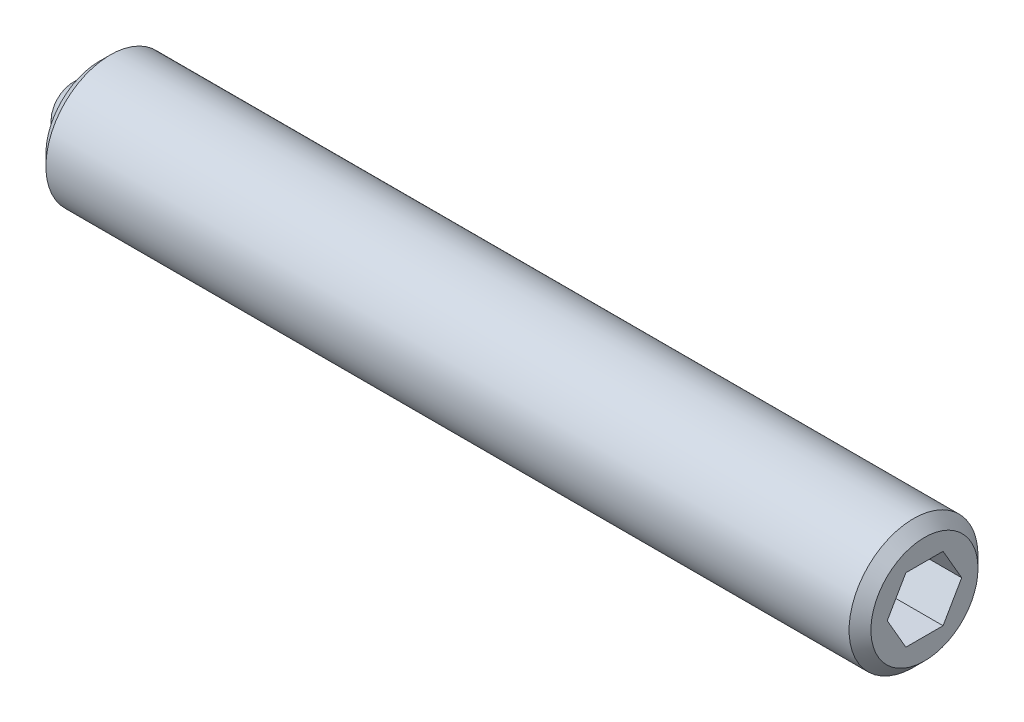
ISO-10303-21;
HEADER;
FILE_DESCRIPTION(('STEP AP214'),'2;1');
FILE_NAME('part.step','',(''),(''),'','','');
FILE_SCHEMA(('AUTOMOTIVE_DESIGN { 1 0 10303 214 1 1 1 1 }'));
ENDSEC;
DATA;
#1=APPLICATION_CONTEXT('core data for automotive mechanical design processes');
#2=APPLICATION_PROTOCOL_DEFINITION('international standard','automotive_design',2000,#1);
#3=PRODUCT_CONTEXT('',#1,'mechanical');
#4=PRODUCT('Part','Part','',(#3));
#5=PRODUCT_RELATED_PRODUCT_CATEGORY('part','',(#4));
#6=PRODUCT_DEFINITION_FORMATION('','',#4);
#7=PRODUCT_DEFINITION_CONTEXT('part definition',#1,'design');
#8=PRODUCT_DEFINITION('design','',#6,#7);
#9=PRODUCT_DEFINITION_SHAPE('','',#8);
#10=(LENGTH_UNIT() NAMED_UNIT(*) SI_UNIT(.MILLI.,.METRE.));
#11=(NAMED_UNIT(*) PLANE_ANGLE_UNIT() SI_UNIT($,.RADIAN.));
#12=(NAMED_UNIT(*) SI_UNIT($,.STERADIAN.) SOLID_ANGLE_UNIT());
#13=UNCERTAINTY_MEASURE_WITH_UNIT(LENGTH_MEASURE(1.E-05),#10,'distance_accuracy_value','');
#14=(GEOMETRIC_REPRESENTATION_CONTEXT(3) GLOBAL_UNCERTAINTY_ASSIGNED_CONTEXT((#13)) GLOBAL_UNIT_ASSIGNED_CONTEXT((#10,
#11,#12)) REPRESENTATION_CONTEXT('',''));
#15=CARTESIAN_POINT('',(0.,0.,0.));
#16=DIRECTION('',(0.,0.,1.));
#17=DIRECTION('',(1.,0.,0.));
#18=AXIS2_PLACEMENT_3D('',#15,#16,#17);
#19=CARTESIAN_POINT('',(0.,0.,0.));
#20=DIRECTION('',(0.,-1.,0.));
#21=DIRECTION('',(0.,0.,-1.));
#22=AXIS2_PLACEMENT_3D('',#19,#20,#21);
#23=SPHERICAL_SURFACE('',#22,0.8);
#24=CARTESIAN_POINT('',(0.,-0.8,0.));
#25=VERTEX_POINT('',#24);
#26=VERTEX_LOOP('',#25);
#27=FACE_BOUND('',#26,.T.);
#28=ADVANCED_FACE('F41',(#27),#23,.T.);
#29=CLOSED_SHELL('',(#28));
#30=MANIFOLD_SOLID_BREP('B2',#29);
#31=CARTESIAN_POINT('',(19.2,0.,0.));
#32=DIRECTION('',(-1.,0.,0.));
#33=DIRECTION('',(0.,0.,1.));
#34=AXIS2_PLACEMENT_3D('',#31,#32,#33);
#35=CYLINDRICAL_SURFACE('',#34,1.5);
#36=CARTESIAN_POINT('',(18.946,0.,0.));
#37=DIRECTION('',(1.,0.,0.));
#38=DIRECTION('',(0.,0.,-1.));
#39=AXIS2_PLACEMENT_3D('',#36,#37,#38);
#40=CIRCLE('',#39,1.5);
#41=CARTESIAN_POINT('',(18.946,0.,-1.5));
#42=VERTEX_POINT('',#41);
#43=EDGE_CURVE('E39',#42,#42,#40,.F.);
#44=ORIENTED_EDGE('',*,*,#43,.T.);
#45=EDGE_LOOP('',(#44));
#46=FACE_BOUND('',#45,.T.);
#47=CARTESIAN_POINT('',(0.254000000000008,0.,0.));
#48=DIRECTION('',(1.,0.,0.));
#49=DIRECTION('',(0.,0.,-1.));
#50=AXIS2_PLACEMENT_3D('',#47,#48,#49);
#51=CIRCLE('',#50,1.5);
#52=CARTESIAN_POINT('',(0.254000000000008,0.,-1.5));
#53=VERTEX_POINT('',#52);
#54=EDGE_CURVE('E176',#53,#53,#51,.T.);
#55=ORIENTED_EDGE('',*,*,#54,.T.);
#56=EDGE_LOOP('',(#55));
#57=FACE_BOUND('',#56,.T.);
#58=ADVANCED_FACE('F54',(#46,#57),#35,.T.);
#59=CARTESIAN_POINT('',(19.2,0.,0.));
#60=DIRECTION('',(1.,0.,0.));
#61=DIRECTION('',(0.,0.,-1.));
#62=AXIS2_PLACEMENT_3D('',#59,#60,#61);
#63=PLANE('',#62);
#64=DIRECTION('',(0.,0.866025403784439,-0.5));
#65=VECTOR('',#64,1.);
#66=CARTESIAN_POINT('',(19.2,-0.75,-0.43301270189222));
#67=LINE('',#66,#65);
#68=CARTESIAN_POINT('',(19.2,-0.75,-0.43301270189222));
#69=VERTEX_POINT('',#68);
#70=CARTESIAN_POINT('',(19.2,0.,-0.866025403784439));
#71=VERTEX_POINT('',#70);
#72=EDGE_CURVE('E77',#69,#71,#67,.T.);
#73=ORIENTED_EDGE('',*,*,#72,.F.);
#74=DIRECTION('',(0.,0.,-1.));
#75=VECTOR('',#74,1.);
#76=CARTESIAN_POINT('',(19.2,-0.75,0.433012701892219));
#77=LINE('',#76,#75);
#78=CARTESIAN_POINT('',(19.2,-0.75,0.433012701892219));
#79=VERTEX_POINT('',#78);
#80=EDGE_CURVE('E143',#79,#69,#77,.T.);
#81=ORIENTED_EDGE('',*,*,#80,.F.);
#82=DIRECTION('',(0.,-0.866025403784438,-0.5));
#83=VECTOR('',#82,1.);
#84=CARTESIAN_POINT('',(19.2,0.,0.866025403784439));
#85=LINE('',#84,#83);
#86=CARTESIAN_POINT('',(19.2,0.,0.866025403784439));
#87=VERTEX_POINT('',#86);
#88=EDGE_CURVE('E169',#87,#79,#85,.T.);
#89=ORIENTED_EDGE('',*,*,#88,.F.);
#90=DIRECTION('',(0.,-0.866025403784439,0.5));
#91=VECTOR('',#90,1.);
#92=CARTESIAN_POINT('',(19.2,0.75,0.433012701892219));
#93=LINE('',#92,#91);
#94=CARTESIAN_POINT('',(19.2,0.75,0.433012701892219));
#95=VERTEX_POINT('',#94);
#96=EDGE_CURVE('E166',#95,#87,#93,.T.);
#97=ORIENTED_EDGE('',*,*,#96,.F.);
#98=DIRECTION('',(0.,0.,1.));
#99=VECTOR('',#98,1.);
#100=CARTESIAN_POINT('',(19.2,0.75,-0.433012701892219));
#101=LINE('',#100,#99);
#102=CARTESIAN_POINT('',(19.2,0.75,-0.433012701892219));
#103=VERTEX_POINT('',#102);
#104=EDGE_CURVE('E163',#103,#95,#101,.T.);
#105=ORIENTED_EDGE('',*,*,#104,.F.);
#106=DIRECTION('',(0.,0.866025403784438,0.5));
#107=VECTOR('',#106,1.);
#108=CARTESIAN_POINT('',(19.2,0.,-0.866025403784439));
#109=LINE('',#108,#107);
#110=EDGE_CURVE('E160',#71,#103,#109,.T.);
#111=ORIENTED_EDGE('',*,*,#110,.F.);
#112=EDGE_LOOP('',(#73,#81,#89,#97,#105,#111));
#113=FACE_BOUND('',#112,.T.);
#114=CARTESIAN_POINT('',(19.2,0.,0.));
#115=DIRECTION('',(1.,0.,0.));
#116=DIRECTION('',(0.,0.,-1.));
#117=AXIS2_PLACEMENT_3D('',#114,#115,#116);
#118=CIRCLE('',#117,1.246);
#119=CARTESIAN_POINT('',(19.2,0.,-1.246));
#120=VERTEX_POINT('',#119);
#121=EDGE_CURVE('E62',#120,#120,#118,.T.);
#122=ORIENTED_EDGE('',*,*,#121,.T.);
#123=EDGE_LOOP('',(#122));
#124=FACE_BOUND('',#123,.T.);
#125=ADVANCED_FACE('F193',(#113,#124),#63,.T.);
#126=CARTESIAN_POINT('',(0.,0.,0.));
#127=DIRECTION('',(1.,0.,0.));
#128=DIRECTION('',(0.,0.,-1.));
#129=AXIS2_PLACEMENT_3D('',#126,#127,#128);
#130=PLANE('',#129);
#131=CARTESIAN_POINT('',(0.,0.,0.));
#132=DIRECTION('',(-1.,0.,0.));
#133=DIRECTION('',(0.,0.,1.));
#134=AXIS2_PLACEMENT_3D('',#131,#132,#133);
#135=CIRCLE('',#134,0.8);
#136=CARTESIAN_POINT('',(0.,0.79747984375,-0.0634499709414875));
#137=VERTEX_POINT('',#136);
#138=CARTESIAN_POINT('',(0.,0.79747984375,0.0634499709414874));
#139=VERTEX_POINT('',#138);
#140=EDGE_CURVE('E128',#137,#139,#135,.T.);
#141=ORIENTED_EDGE('',*,*,#140,.F.);
#142=CARTESIAN_POINT('',(0.,0.8,0.));
#143=DIRECTION('',(-1.,0.,0.));
#144=DIRECTION('',(0.,0.,1.));
#145=AXIS2_PLACEMENT_3D('',#142,#143,#144);
#146=CIRCLE('',#145,0.0635000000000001);
#147=EDGE_CURVE('E117',#139,#137,#146,.T.);
#148=ORIENTED_EDGE('',*,*,#147,.F.);
#149=EDGE_LOOP('',(#141,#148));
#150=FACE_BOUND('',#149,.T.);
#151=CARTESIAN_POINT('',(0.,0.,0.));
#152=DIRECTION('',(1.,0.,0.));
#153=DIRECTION('',(0.,0.,-1.));
#154=AXIS2_PLACEMENT_3D('',#151,#152,#153);
#155=CIRCLE('',#154,1.24599999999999);
#156=CARTESIAN_POINT('',(0.,0.,-1.24599999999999));
#157=VERTEX_POINT('',#156);
#158=EDGE_CURVE('E188',#157,#157,#155,.F.);
#159=ORIENTED_EDGE('',*,*,#158,.T.);
#160=EDGE_LOOP('',(#159));
#161=FACE_BOUND('',#160,.T.);
#162=ADVANCED_FACE('F132',(#150,#161),#130,.F.);
#163=CARTESIAN_POINT('',(0.254000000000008,0.,0.));
#164=DIRECTION('',(1.,0.,0.));
#165=DIRECTION('',(0.,0.,-1.));
#166=AXIS2_PLACEMENT_3D('',#163,#164,#165);
#167=CONICAL_SURFACE('',#166,1.5,0.785398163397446);
#168=ORIENTED_EDGE('',*,*,#158,.F.);
#169=EDGE_LOOP('',(#168));
#170=FACE_BOUND('',#169,.T.);
#171=ORIENTED_EDGE('',*,*,#54,.F.);
#172=EDGE_LOOP('',(#171));
#173=FACE_BOUND('',#172,.T.);
#174=ADVANCED_FACE('F197',(#170,#173),#167,.T.);
#175=CARTESIAN_POINT('',(19.2,0.,0.));
#176=DIRECTION('',(-1.,0.,0.));
#177=DIRECTION('',(0.,0.,1.));
#178=AXIS2_PLACEMENT_3D('',#175,#176,#177);
#179=CONICAL_SURFACE('',#178,1.246,0.785398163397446);
#180=ORIENTED_EDGE('',*,*,#43,.F.);
#181=EDGE_LOOP('',(#180));
#182=FACE_BOUND('',#181,.T.);
#183=ORIENTED_EDGE('',*,*,#121,.F.);
#184=EDGE_LOOP('',(#183));
#185=FACE_BOUND('',#184,.T.);
#186=ADVANCED_FACE('F56',(#182,#185),#179,.T.);
#187=CARTESIAN_POINT('',(17.2,-0.75,-0.43301270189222));
#188=DIRECTION('',(0.,-0.5,-0.866025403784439));
#189=DIRECTION('',(0.,0.866025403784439,-0.5));
#190=AXIS2_PLACEMENT_3D('',#187,#188,#189);
#191=PLANE('',#190);
#192=ORIENTED_EDGE('',*,*,#72,.T.);
#193=DIRECTION('',(1.,0.,0.));
#194=VECTOR('',#193,1.);
#195=CARTESIAN_POINT('',(17.2,0.,-0.866025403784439));
#196=LINE('',#195,#194);
#197=CARTESIAN_POINT('',(17.2,0.,-0.866025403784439));
#198=VERTEX_POINT('',#197);
#199=EDGE_CURVE('E158',#198,#71,#196,.T.);
#200=ORIENTED_EDGE('',*,*,#199,.F.);
#201=DIRECTION('',(0.,0.866025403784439,-0.5));
#202=VECTOR('',#201,1.);
#203=CARTESIAN_POINT('',(17.2,-0.75,-0.43301270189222));
#204=LINE('',#203,#202);
#205=CARTESIAN_POINT('',(17.2,-0.75,-0.43301270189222));
#206=VERTEX_POINT('',#205);
#207=EDGE_CURVE('E139',#206,#198,#204,.T.);
#208=ORIENTED_EDGE('',*,*,#207,.F.);
#209=DIRECTION('',(1.,0.,0.));
#210=VECTOR('',#209,1.);
#211=CARTESIAN_POINT('',(17.2,-0.75,-0.43301270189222));
#212=LINE('',#211,#210);
#213=EDGE_CURVE('E174',#206,#69,#212,.T.);
#214=ORIENTED_EDGE('',*,*,#213,.T.);
#215=EDGE_LOOP('',(#192,#200,#208,#214));
#216=FACE_BOUND('',#215,.T.);
#217=ADVANCED_FACE('F196',(#216),#191,.F.);
#218=CARTESIAN_POINT('',(17.2,-0.75,0.433012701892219));
#219=DIRECTION('',(0.,-1.,0.));
#220=DIRECTION('',(0.,0.,-1.));
#221=AXIS2_PLACEMENT_3D('',#218,#219,#220);
#222=PLANE('',#221);
#223=ORIENTED_EDGE('',*,*,#80,.T.);
#224=ORIENTED_EDGE('',*,*,#213,.F.);
#225=DIRECTION('',(0.,0.,-1.));
#226=VECTOR('',#225,1.);
#227=CARTESIAN_POINT('',(17.2,-0.75,0.433012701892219));
#228=LINE('',#227,#226);
#229=CARTESIAN_POINT('',(17.2,-0.75,0.433012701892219));
#230=VERTEX_POINT('',#229);
#231=EDGE_CURVE('E155',#230,#206,#228,.T.);
#232=ORIENTED_EDGE('',*,*,#231,.F.);
#233=DIRECTION('',(1.,0.,0.));
#234=VECTOR('',#233,1.);
#235=CARTESIAN_POINT('',(17.2,-0.75,0.433012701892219));
#236=LINE('',#235,#234);
#237=EDGE_CURVE('E177',#230,#79,#236,.T.);
#238=ORIENTED_EDGE('',*,*,#237,.T.);
#239=EDGE_LOOP('',(#223,#224,#232,#238));
#240=FACE_BOUND('',#239,.T.);
#241=ADVANCED_FACE('F203',(#240),#222,.F.);
#242=CARTESIAN_POINT('',(17.2,0.,0.866025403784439));
#243=DIRECTION('',(0.,-0.5,0.866025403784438));
#244=DIRECTION('',(0.,-0.866025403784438,-0.5));
#245=AXIS2_PLACEMENT_3D('',#242,#243,#244);
#246=PLANE('',#245);
#247=ORIENTED_EDGE('',*,*,#88,.T.);
#248=ORIENTED_EDGE('',*,*,#237,.F.);
#249=DIRECTION('',(0.,-0.866025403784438,-0.5));
#250=VECTOR('',#249,1.);
#251=CARTESIAN_POINT('',(17.2,0.,0.866025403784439));
#252=LINE('',#251,#250);
#253=CARTESIAN_POINT('',(17.2,0.,0.866025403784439));
#254=VERTEX_POINT('',#253);
#255=EDGE_CURVE('E152',#254,#230,#252,.T.);
#256=ORIENTED_EDGE('',*,*,#255,.F.);
#257=DIRECTION('',(1.,0.,0.));
#258=VECTOR('',#257,1.);
#259=CARTESIAN_POINT('',(17.2,0.,0.866025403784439));
#260=LINE('',#259,#258);
#261=EDGE_CURVE('E179',#254,#87,#260,.T.);
#262=ORIENTED_EDGE('',*,*,#261,.T.);
#263=EDGE_LOOP('',(#247,#248,#256,#262));
#264=FACE_BOUND('',#263,.T.);
#265=ADVANCED_FACE('F231',(#264),#246,.F.);
#266=CARTESIAN_POINT('',(17.2,0.75,0.433012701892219));
#267=DIRECTION('',(0.,0.5,0.866025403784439));
#268=DIRECTION('',(0.,-0.866025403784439,0.5));
#269=AXIS2_PLACEMENT_3D('',#266,#267,#268);
#270=PLANE('',#269);
#271=ORIENTED_EDGE('',*,*,#96,.T.);
#272=ORIENTED_EDGE('',*,*,#261,.F.);
#273=DIRECTION('',(0.,-0.866025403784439,0.5));
#274=VECTOR('',#273,1.);
#275=CARTESIAN_POINT('',(17.2,0.75,0.433012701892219));
#276=LINE('',#275,#274);
#277=CARTESIAN_POINT('',(17.2,0.75,0.433012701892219));
#278=VERTEX_POINT('',#277);
#279=EDGE_CURVE('E149',#278,#254,#276,.T.);
#280=ORIENTED_EDGE('',*,*,#279,.F.);
#281=DIRECTION('',(1.,0.,0.));
#282=VECTOR('',#281,1.);
#283=CARTESIAN_POINT('',(17.2,0.75,0.433012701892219));
#284=LINE('',#283,#282);
#285=EDGE_CURVE('E181',#278,#95,#284,.T.);
#286=ORIENTED_EDGE('',*,*,#285,.T.);
#287=EDGE_LOOP('',(#271,#272,#280,#286));
#288=FACE_BOUND('',#287,.T.);
#289=ADVANCED_FACE('F227',(#288),#270,.F.);
#290=CARTESIAN_POINT('',(17.2,0.75,-0.433012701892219));
#291=DIRECTION('',(0.,1.,0.));
#292=DIRECTION('',(0.,0.,1.));
#293=AXIS2_PLACEMENT_3D('',#290,#291,#292);
#294=PLANE('',#293);
#295=ORIENTED_EDGE('',*,*,#104,.T.);
#296=ORIENTED_EDGE('',*,*,#285,.F.);
#297=DIRECTION('',(0.,0.,1.));
#298=VECTOR('',#297,1.);
#299=CARTESIAN_POINT('',(17.2,0.75,-0.433012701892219));
#300=LINE('',#299,#298);
#301=CARTESIAN_POINT('',(17.2,0.75,-0.433012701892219));
#302=VERTEX_POINT('',#301);
#303=EDGE_CURVE('E146',#302,#278,#300,.T.);
#304=ORIENTED_EDGE('',*,*,#303,.F.);
#305=DIRECTION('',(1.,0.,0.));
#306=VECTOR('',#305,1.);
#307=CARTESIAN_POINT('',(17.2,0.75,-0.433012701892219));
#308=LINE('',#307,#306);
#309=EDGE_CURVE('E183',#302,#103,#308,.T.);
#310=ORIENTED_EDGE('',*,*,#309,.T.);
#311=EDGE_LOOP('',(#295,#296,#304,#310));
#312=FACE_BOUND('',#311,.T.);
#313=ADVANCED_FACE('F223',(#312),#294,.F.);
#314=CARTESIAN_POINT('',(17.2,0.,-0.866025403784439));
#315=DIRECTION('',(0.,0.500000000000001,-0.866025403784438));
#316=DIRECTION('',(0.,0.866025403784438,0.500000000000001));
#317=AXIS2_PLACEMENT_3D('',#314,#315,#316);
#318=PLANE('',#317);
#319=ORIENTED_EDGE('',*,*,#110,.T.);
#320=ORIENTED_EDGE('',*,*,#309,.F.);
#321=DIRECTION('',(0.,0.866025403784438,0.5));
#322=VECTOR('',#321,1.);
#323=CARTESIAN_POINT('',(17.2,0.,-0.866025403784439));
#324=LINE('',#323,#322);
#325=EDGE_CURVE('E142',#198,#302,#324,.T.);
#326=ORIENTED_EDGE('',*,*,#325,.F.);
#327=ORIENTED_EDGE('',*,*,#199,.T.);
#328=EDGE_LOOP('',(#319,#320,#326,#327));
#329=FACE_BOUND('',#328,.T.);
#330=ADVANCED_FACE('F219',(#329),#318,.F.);
#331=CARTESIAN_POINT('',(17.2,0.,0.));
#332=DIRECTION('',(1.,0.,0.));
#333=DIRECTION('',(0.,0.,-1.));
#334=AXIS2_PLACEMENT_3D('',#331,#332,#333);
#335=PLANE('',#334);
#336=ORIENTED_EDGE('',*,*,#207,.T.);
#337=ORIENTED_EDGE('',*,*,#325,.T.);
#338=ORIENTED_EDGE('',*,*,#303,.T.);
#339=ORIENTED_EDGE('',*,*,#279,.T.);
#340=ORIENTED_EDGE('',*,*,#255,.T.);
#341=ORIENTED_EDGE('',*,*,#231,.T.);
#342=EDGE_LOOP('',(#336,#337,#338,#339,#340,#341));
#343=FACE_BOUND('',#342,.T.);
#344=ADVANCED_FACE('F222',(#343),#335,.T.);
#345=CARTESIAN_POINT('',(0.8,0.,0.));
#346=DIRECTION('',(-1.,0.,0.));
#347=DIRECTION('',(0.,0.,1.));
#348=AXIS2_PLACEMENT_3D('',#345,#346,#347);
#349=CYLINDRICAL_SURFACE('',#348,0.8);
#350=CARTESIAN_POINT('',(0.8,0.,0.));
#351=DIRECTION('',(-1.,0.,0.));
#352=DIRECTION('',(0.,0.,1.));
#353=AXIS2_PLACEMENT_3D('',#350,#351,#352);
#354=CIRCLE('',#353,0.8);
#355=CARTESIAN_POINT('',(0.8,0.79747984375,-0.0634499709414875));
#356=VERTEX_POINT('',#355);
#357=CARTESIAN_POINT('',(0.8,0.79747984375,0.0634499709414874));
#358=VERTEX_POINT('',#357);
#359=EDGE_CURVE('E130',#356,#358,#354,.T.);
#360=ORIENTED_EDGE('',*,*,#359,.F.);
#361=DIRECTION('',(-1.,0.,0.));
#362=VECTOR('',#361,1.);
#363=CARTESIAN_POINT('',(0.94313511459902,0.79747984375,-0.0634499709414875));
#364=LINE('',#363,#362);
#365=EDGE_CURVE('E69',#356,#137,#364,.T.);
#366=ORIENTED_EDGE('',*,*,#365,.T.);
#367=ORIENTED_EDGE('',*,*,#140,.T.);
#368=DIRECTION('',(-1.,0.,0.));
#369=VECTOR('',#368,1.);
#370=CARTESIAN_POINT('',(0.94313511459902,0.79747984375,0.0634499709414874));
#371=LINE('',#370,#369);
#372=EDGE_CURVE('E120',#358,#139,#371,.T.);
#373=ORIENTED_EDGE('',*,*,#372,.F.);
#374=EDGE_LOOP('',(#360,#366,#367,#373));
#375=FACE_BOUND('',#374,.T.);
#376=ADVANCED_FACE('F127',(#375),#349,.F.);
#377=CARTESIAN_POINT('',(0.8,0.,0.));
#378=DIRECTION('',(-1.,0.,0.));
#379=DIRECTION('',(0.,0.,1.));
#380=AXIS2_PLACEMENT_3D('',#377,#378,#379);
#381=PLANE('',#380);
#382=ORIENTED_EDGE('',*,*,#359,.T.);
#383=CARTESIAN_POINT('',(0.8,0.8,0.));
#384=DIRECTION('',(-1.,0.,0.));
#385=DIRECTION('',(0.,0.,1.));
#386=AXIS2_PLACEMENT_3D('',#383,#384,#385);
#387=CIRCLE('',#386,0.0635000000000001);
#388=EDGE_CURVE('E134',#356,#358,#387,.F.);
#389=ORIENTED_EDGE('',*,*,#388,.F.);
#390=EDGE_LOOP('',(#382,#389));
#391=FACE_BOUND('',#390,.T.);
#392=ADVANCED_FACE('F244',(#391),#381,.T.);
#393=CARTESIAN_POINT('',(0.94313511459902,0.8,0.));
#394=DIRECTION('',(-1.,0.,0.));
#395=DIRECTION('',(0.,0.,1.));
#396=AXIS2_PLACEMENT_3D('',#393,#394,#395);
#397=CYLINDRICAL_SURFACE('',#396,0.0635000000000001);
#398=ORIENTED_EDGE('',*,*,#388,.T.);
#399=ORIENTED_EDGE('',*,*,#372,.T.);
#400=ORIENTED_EDGE('',*,*,#147,.T.);
#401=ORIENTED_EDGE('',*,*,#365,.F.);
#402=EDGE_LOOP('',(#398,#399,#400,#401));
#403=FACE_BOUND('',#402,.T.);
#404=ADVANCED_FACE('F118',(#403),#397,.F.);
#405=CLOSED_SHELL('',(#58,#125,#162,#174,#186,#217,#241,#265,#289,#313,#330,#344,#376,#392,#404));
#406=MANIFOLD_SOLID_BREP('B6',#405);
#407=ADVANCED_BREP_SHAPE_REPRESENTATION('',(#18,#30,#406),#14);
#408=SHAPE_DEFINITION_REPRESENTATION(#9,#407);
ENDSEC;
END-ISO-10303-21;
